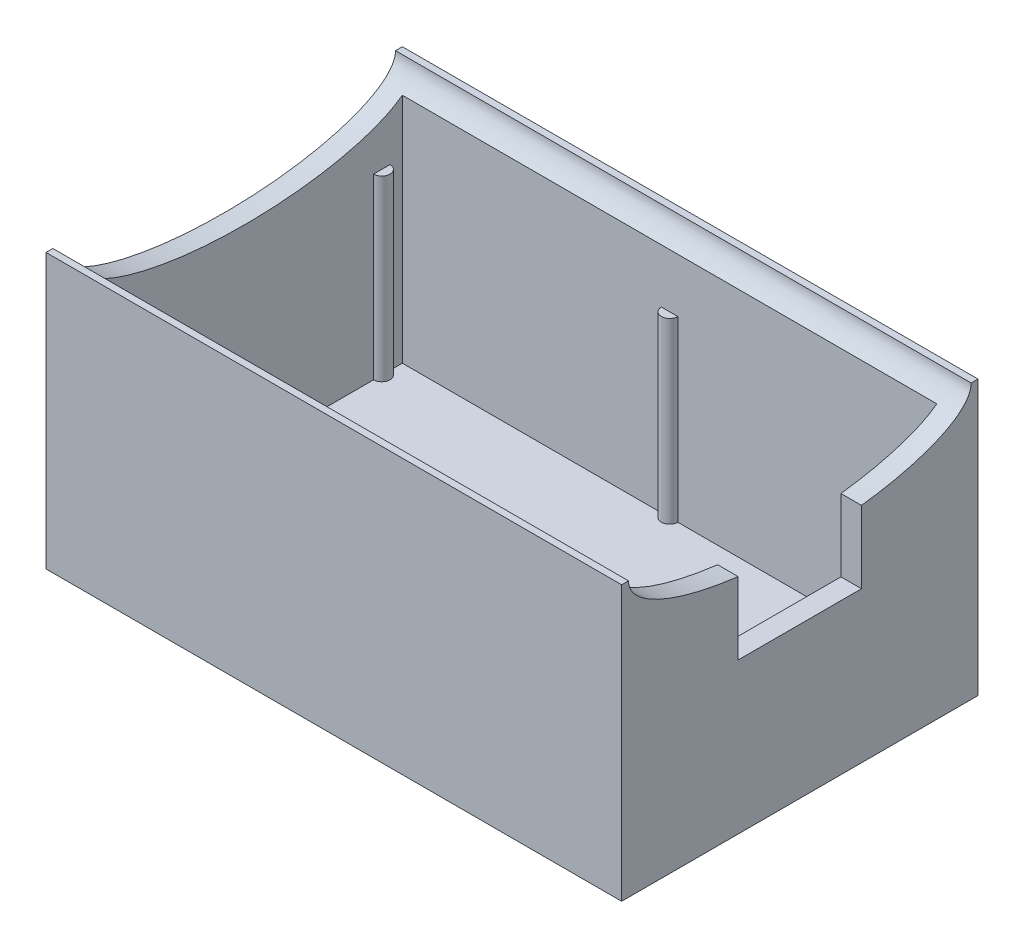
from build123d import *

# Parameters (mm, degrees)
SKETCH1_W           = 42
SKETCH1_H           = 26
BOSS_EXTRUDE1_DEPTH = 20
SHELL1_T            = -1.5
SKETCH2_RX          = 12.5
SKETCH2_RY          = 4
CUT_EXTRUDE1_DEPTH  = 54.291650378
SKETCH3_R           = 0.6
BOSS_EXTRUDE2_DEPTH = 13
SKETCH4_W           = 9
SKETCH4_H           = 9.893876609
CUT_EXTRUDE2_DEPTH  = 13


with BuildPart() as part:
    # Sketch1 → Boss-Extrude1 (new body)
    with BuildSketch(Plane(origin=(0, 0, 0), x_dir=(1, 0, 0), z_dir=(0, 1, 0))):
        with Locations((-21, 13)):
            Rectangle(SKETCH1_W, SKETCH1_H)
    extrude(amount=BOSS_EXTRUDE1_DEPTH)

    # Shell1
    shell1_openings = [part.faces().sort_by_distance(p)[0] for p in [
        (-21, 20, -13),
    ]]
    offset(amount=SHELL1_T, openings=shell1_openings, kind=Kind.INTERSECTION)

    # Sketch2 → Cut-Extrude1 (cut, through all)
    with BuildSketch(Plane.ZY.offset(42)):
        with Locations((-13, 20)):
            Ellipse(SKETCH2_RX, SKETCH2_RY)
    extrude(amount=-CUT_EXTRUDE1_DEPTH, mode=Mode.SUBTRACT)

    # Sketch3 → Boss-Extrude2 (add)
    with BuildSketch(Plane(origin=(0, 1.5, 0), x_dir=(1, 0, 0), z_dir=(0, 1, 0))):
        with Locations((-40.5, 23)):
            Circle(SKETCH3_R)
        with Locations((-40.5, 3)):
            Circle(SKETCH3_R)
        with Locations((-21, 1.5)):
            Circle(SKETCH3_R)
        with Locations((-21, 24.5)):
            Circle(SKETCH3_R)
        with Locations((-1.5, 23)):
            Circle(SKETCH3_R)
        with Locations((-1.5, 3)):
            Circle(SKETCH3_R)
    extrude(amount=BOSS_EXTRUDE2_DEPTH)

    # Sketch4 → Cut-Extrude2 (cut)
    with BuildSketch(Plane(origin=(0, 0, 0), x_dir=(0, 0, -1), z_dir=(1, 0, 0))):
        with Locations((13, 15.946938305)):
            Rectangle(SKETCH4_W, SKETCH4_H)
    extrude(amount=-CUT_EXTRUDE2_DEPTH, mode=Mode.SUBTRACT)


solid = part.part
